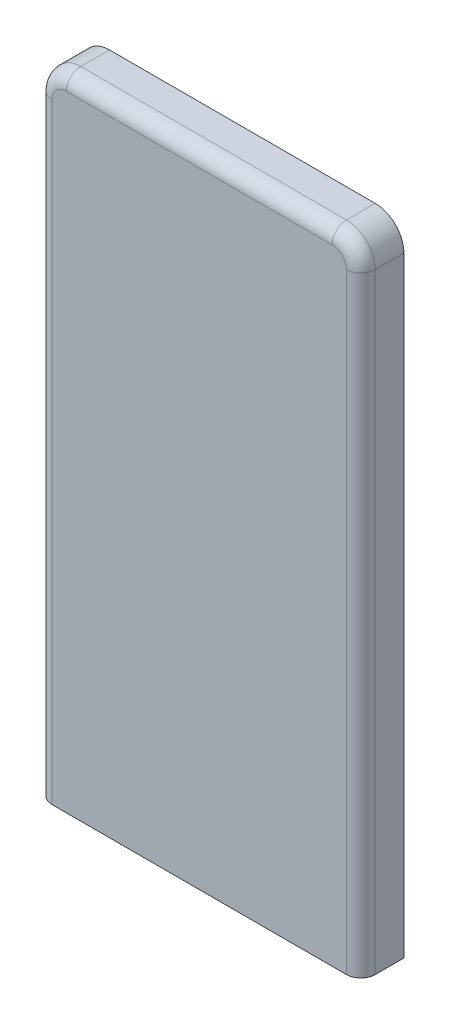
ISO-10303-21;
HEADER;
FILE_DESCRIPTION(('STEP AP214'),'2;1');
FILE_NAME('part.step','',(''),(''),'','','');
FILE_SCHEMA(('AUTOMOTIVE_DESIGN { 1 0 10303 214 1 1 1 1 }'));
ENDSEC;
DATA;
#1=APPLICATION_CONTEXT('core data for automotive mechanical design processes');
#2=APPLICATION_PROTOCOL_DEFINITION('international standard','automotive_design',2000,#1);
#3=PRODUCT_CONTEXT('',#1,'mechanical');
#4=PRODUCT('Part','Part','',(#3));
#5=PRODUCT_RELATED_PRODUCT_CATEGORY('part','',(#4));
#6=PRODUCT_DEFINITION_FORMATION('','',#4);
#7=PRODUCT_DEFINITION_CONTEXT('part definition',#1,'design');
#8=PRODUCT_DEFINITION('design','',#6,#7);
#9=PRODUCT_DEFINITION_SHAPE('','',#8);
#10=(LENGTH_UNIT() NAMED_UNIT(*) SI_UNIT(.MILLI.,.METRE.));
#11=(NAMED_UNIT(*) PLANE_ANGLE_UNIT() SI_UNIT($,.RADIAN.));
#12=(NAMED_UNIT(*) SI_UNIT($,.STERADIAN.) SOLID_ANGLE_UNIT());
#13=UNCERTAINTY_MEASURE_WITH_UNIT(LENGTH_MEASURE(1.E-05),#10,'distance_accuracy_value','');
#14=(GEOMETRIC_REPRESENTATION_CONTEXT(3) GLOBAL_UNCERTAINTY_ASSIGNED_CONTEXT((#13)) GLOBAL_UNIT_ASSIGNED_CONTEXT((#10,
#11,#12)) REPRESENTATION_CONTEXT('',''));
#15=CARTESIAN_POINT('',(0.,0.,0.));
#16=DIRECTION('',(0.,0.,1.));
#17=DIRECTION('',(1.,0.,0.));
#18=AXIS2_PLACEMENT_3D('',#15,#16,#17);
#19=CARTESIAN_POINT('',(-112.5,143.5,-30.));
#20=DIRECTION('',(-1.,0.,0.));
#21=DIRECTION('',(0.,-1.,0.));
#22=AXIS2_PLACEMENT_3D('',#19,#20,#21);
#23=PLANE('',#22);
#24=DIRECTION('',(0.,0.,1.));
#25=VECTOR('',#24,1.);
#26=CARTESIAN_POINT('',(-112.5,-301.5,-30.));
#27=LINE('',#26,#25);
#28=CARTESIAN_POINT('',(-112.5,-301.5,-30.));
#29=VERTEX_POINT('',#28);
#30=CARTESIAN_POINT('',(-112.5,-301.5,-10.));
#31=VERTEX_POINT('',#30);
#32=EDGE_CURVE('E260',#29,#31,#27,.T.);
#33=ORIENTED_EDGE('',*,*,#32,.T.);
#34=DIRECTION('',(0.,-1.,0.));
#35=VECTOR('',#34,1.);
#36=CARTESIAN_POINT('',(-112.5,143.5,-10.));
#37=LINE('',#36,#35);
#38=CARTESIAN_POINT('',(-112.5,123.5,-10.));
#39=VERTEX_POINT('',#38);
#40=EDGE_CURVE('E298',#31,#39,#37,.F.);
#41=ORIENTED_EDGE('',*,*,#40,.T.);
#42=DIRECTION('',(0.,0.,1.));
#43=VECTOR('',#42,1.);
#44=CARTESIAN_POINT('',(-112.5,123.5,-30.));
#45=LINE('',#44,#43);
#46=CARTESIAN_POINT('',(-112.5,123.5,-30.));
#47=VERTEX_POINT('',#46);
#48=EDGE_CURVE('E279',#39,#47,#45,.F.);
#49=ORIENTED_EDGE('',*,*,#48,.T.);
#50=DIRECTION('',(0.,-1.,0.));
#51=VECTOR('',#50,1.);
#52=CARTESIAN_POINT('',(-112.5,143.5,-30.));
#53=LINE('',#52,#51);
#54=EDGE_CURVE('E247',#47,#29,#53,.T.);
#55=ORIENTED_EDGE('',*,*,#54,.T.);
#56=EDGE_LOOP('',(#33,#41,#49,#55));
#57=FACE_BOUND('',#56,.T.);
#58=ADVANCED_FACE('F38',(#57),#23,.T.);
#59=CARTESIAN_POINT('',(-112.5,143.5,-30.));
#60=DIRECTION('',(0.,1.,0.));
#61=DIRECTION('',(-1.,0.,0.));
#62=AXIS2_PLACEMENT_3D('',#59,#60,#61);
#63=PLANE('',#62);
#64=DIRECTION('',(0.,0.,1.));
#65=VECTOR('',#64,1.);
#66=CARTESIAN_POINT('',(-92.5,143.5,-30.));
#67=LINE('',#66,#65);
#68=CARTESIAN_POINT('',(-92.5,143.5,-30.));
#69=VERTEX_POINT('',#68);
#70=CARTESIAN_POINT('',(-92.5,143.5,-10.));
#71=VERTEX_POINT('',#70);
#72=EDGE_CURVE('E271',#69,#71,#67,.T.);
#73=ORIENTED_EDGE('',*,*,#72,.T.);
#74=DIRECTION('',(-1.,0.,0.));
#75=VECTOR('',#74,1.);
#76=CARTESIAN_POINT('',(-112.5,143.5,-10.));
#77=LINE('',#76,#75);
#78=CARTESIAN_POINT('',(92.5,143.5,-10.));
#79=VERTEX_POINT('',#78);
#80=EDGE_CURVE('E11',#71,#79,#77,.F.);
#81=ORIENTED_EDGE('',*,*,#80,.T.);
#82=DIRECTION('',(0.,0.,1.));
#83=VECTOR('',#82,1.);
#84=CARTESIAN_POINT('',(92.5,143.5,-30.));
#85=LINE('',#84,#83);
#86=CARTESIAN_POINT('',(92.5,143.5,-30.));
#87=VERTEX_POINT('',#86);
#88=EDGE_CURVE('E273',#79,#87,#85,.F.);
#89=ORIENTED_EDGE('',*,*,#88,.T.);
#90=DIRECTION('',(-1.,0.,0.));
#91=VECTOR('',#90,1.);
#92=CARTESIAN_POINT('',(-112.5,143.5,-30.));
#93=LINE('',#92,#91);
#94=EDGE_CURVE('E257',#87,#69,#93,.T.);
#95=ORIENTED_EDGE('',*,*,#94,.T.);
#96=EDGE_LOOP('',(#73,#81,#89,#95));
#97=FACE_BOUND('',#96,.T.);
#98=ADVANCED_FACE('F356',(#97),#63,.T.);
#99=CARTESIAN_POINT('',(112.5,143.5,-30.));
#100=DIRECTION('',(1.,0.,0.));
#101=DIRECTION('',(0.,1.,0.));
#102=AXIS2_PLACEMENT_3D('',#99,#100,#101);
#103=PLANE('',#102);
#104=DIRECTION('',(0.,0.,1.));
#105=VECTOR('',#104,1.);
#106=CARTESIAN_POINT('',(112.5,123.5,-30.));
#107=LINE('',#106,#105);
#108=CARTESIAN_POINT('',(112.5,123.5,-30.));
#109=VERTEX_POINT('',#108);
#110=CARTESIAN_POINT('',(112.5,123.5,-10.));
#111=VERTEX_POINT('',#110);
#112=EDGE_CURVE('E266',#109,#111,#107,.T.);
#113=ORIENTED_EDGE('',*,*,#112,.T.);
#114=DIRECTION('',(0.,1.,0.));
#115=VECTOR('',#114,1.);
#116=CARTESIAN_POINT('',(112.5,143.5,-10.));
#117=LINE('',#116,#115);
#118=CARTESIAN_POINT('',(112.5,-301.5,-10.));
#119=VERTEX_POINT('',#118);
#120=EDGE_CURVE('E292',#111,#119,#117,.F.);
#121=ORIENTED_EDGE('',*,*,#120,.T.);
#122=DIRECTION('',(0.,0.,1.));
#123=VECTOR('',#122,1.);
#124=CARTESIAN_POINT('',(112.5,-301.5,-30.));
#125=LINE('',#124,#123);
#126=CARTESIAN_POINT('',(112.5,-301.5,-30.));
#127=VERTEX_POINT('',#126);
#128=EDGE_CURVE('E263',#127,#119,#125,.T.);
#129=ORIENTED_EDGE('',*,*,#128,.F.);
#130=DIRECTION('',(0.,1.,0.));
#131=VECTOR('',#130,1.);
#132=CARTESIAN_POINT('',(112.5,143.5,-30.));
#133=LINE('',#132,#131);
#134=EDGE_CURVE('E254',#127,#109,#133,.T.);
#135=ORIENTED_EDGE('',*,*,#134,.T.);
#136=EDGE_LOOP('',(#113,#121,#129,#135));
#137=FACE_BOUND('',#136,.T.);
#138=ADVANCED_FACE('F347',(#137),#103,.T.);
#139=CARTESIAN_POINT('',(-112.5,-301.5,-30.));
#140=DIRECTION('',(0.,-1.,0.));
#141=DIRECTION('',(0.,0.,-1.));
#142=AXIS2_PLACEMENT_3D('',#139,#140,#141);
#143=PLANE('',#142);
#144=DIRECTION('',(0.,0.,1.));
#145=VECTOR('',#144,1.);
#146=CARTESIAN_POINT('',(110.5,-301.5,-30.));
#147=LINE('',#146,#145);
#148=CARTESIAN_POINT('',(110.5,-301.5,-30.));
#149=VERTEX_POINT('',#148);
#150=CARTESIAN_POINT('',(110.5,-301.5,-10.));
#151=VERTEX_POINT('',#150);
#152=EDGE_CURVE('E212',#149,#151,#147,.T.);
#153=ORIENTED_EDGE('',*,*,#152,.F.);
#154=DIRECTION('',(1.,0.,0.));
#155=VECTOR('',#154,1.);
#156=CARTESIAN_POINT('',(-112.5,-301.5,-30.));
#157=LINE('',#156,#155);
#158=EDGE_CURVE('E249',#149,#127,#157,.T.);
#159=ORIENTED_EDGE('',*,*,#158,.T.);
#160=ORIENTED_EDGE('',*,*,#128,.T.);
#161=CARTESIAN_POINT('',(102.5,-301.5,-10.));
#162=DIRECTION('',(0.,-1.,0.));
#163=DIRECTION('',(0.,0.,-1.));
#164=AXIS2_PLACEMENT_3D('',#161,#162,#163);
#165=CIRCLE('',#164,10.);
#166=CARTESIAN_POINT('',(102.5,-301.5,0.));
#167=VERTEX_POINT('',#166);
#168=EDGE_CURVE('E296',#119,#167,#165,.T.);
#169=ORIENTED_EDGE('',*,*,#168,.T.);
#170=DIRECTION('',(1.,0.,0.));
#171=VECTOR('',#170,1.);
#172=CARTESIAN_POINT('',(-112.5,-301.5,0.));
#173=LINE('',#172,#171);
#174=CARTESIAN_POINT('',(-102.5,-301.5,0.));
#175=VERTEX_POINT('',#174);
#176=EDGE_CURVE('E250',#175,#167,#173,.T.);
#177=ORIENTED_EDGE('',*,*,#176,.F.);
#178=CARTESIAN_POINT('',(-102.5,-301.5,-10.));
#179=DIRECTION('',(0.,-1.,0.));
#180=DIRECTION('',(0.,0.,-1.));
#181=AXIS2_PLACEMENT_3D('',#178,#179,#180);
#182=CIRCLE('',#181,10.);
#183=EDGE_CURVE('E294',#175,#31,#182,.T.);
#184=ORIENTED_EDGE('',*,*,#183,.T.);
#185=ORIENTED_EDGE('',*,*,#32,.F.);
#186=CARTESIAN_POINT('',(-110.5,-301.5,-30.));
#187=VERTEX_POINT('',#186);
#188=EDGE_CURVE('E251',#29,#187,#157,.T.);
#189=ORIENTED_EDGE('',*,*,#188,.T.);
#190=DIRECTION('',(0.,0.,1.));
#191=VECTOR('',#190,1.);
#192=CARTESIAN_POINT('',(-110.5,-301.5,-30.));
#193=LINE('',#192,#191);
#194=CARTESIAN_POINT('',(-110.5,-301.5,-10.));
#195=VERTEX_POINT('',#194);
#196=EDGE_CURVE('E230',#187,#195,#193,.T.);
#197=ORIENTED_EDGE('',*,*,#196,.T.);
#198=CARTESIAN_POINT('',(-102.5,-301.5,-10.));
#199=DIRECTION('',(0.,-1.,0.));
#200=DIRECTION('',(0.,0.,-1.));
#201=AXIS2_PLACEMENT_3D('',#198,#199,#200);
#202=CIRCLE('',#201,8.);
#203=CARTESIAN_POINT('',(-102.5,-301.5,-2.));
#204=VERTEX_POINT('',#203);
#205=EDGE_CURVE('E171',#204,#195,#202,.T.);
#206=ORIENTED_EDGE('',*,*,#205,.F.);
#207=DIRECTION('',(1.,0.,0.));
#208=VECTOR('',#207,1.);
#209=CARTESIAN_POINT('',(-112.5,-301.5,-2.));
#210=LINE('',#209,#208);
#211=CARTESIAN_POINT('',(102.5,-301.5,-2.));
#212=VERTEX_POINT('',#211);
#213=EDGE_CURVE('E192',#204,#212,#210,.T.);
#214=ORIENTED_EDGE('',*,*,#213,.T.);
#215=CARTESIAN_POINT('',(102.5,-301.5,-10.));
#216=DIRECTION('',(0.,-1.,0.));
#217=DIRECTION('',(0.,0.,-1.));
#218=AXIS2_PLACEMENT_3D('',#215,#216,#217);
#219=CIRCLE('',#218,8.);
#220=EDGE_CURVE('E174',#151,#212,#219,.T.);
#221=ORIENTED_EDGE('',*,*,#220,.F.);
#222=EDGE_LOOP('',(#153,#159,#160,#169,#177,#184,#185,#189,#197,#206,#214,#221));
#223=FACE_BOUND('',#222,.T.);
#224=ADVANCED_FACE('F327',(#223),#143,.T.);
#225=CARTESIAN_POINT('',(-112.5,143.5,-30.));
#226=DIRECTION('',(0.,0.,1.));
#227=DIRECTION('',(1.,0.,0.));
#228=AXIS2_PLACEMENT_3D('',#225,#226,#227);
#229=PLANE('',#228);
#230=ORIENTED_EDGE('',*,*,#158,.F.);
#231=DIRECTION('',(0.,1.,0.));
#232=VECTOR('',#231,1.);
#233=CARTESIAN_POINT('',(110.5,143.5,-30.));
#234=LINE('',#233,#232);
#235=CARTESIAN_POINT('',(110.5,123.5,-30.));
#236=VERTEX_POINT('',#235);
#237=EDGE_CURVE('E234',#149,#236,#234,.T.);
#238=ORIENTED_EDGE('',*,*,#237,.T.);
#239=CARTESIAN_POINT('',(92.5,123.5,-30.));
#240=DIRECTION('',(0.,0.,1.));
#241=DIRECTION('',(1.,0.,0.));
#242=AXIS2_PLACEMENT_3D('',#239,#240,#241);
#243=CIRCLE('',#242,18.);
#244=CARTESIAN_POINT('',(92.5,141.5,-30.));
#245=VERTEX_POINT('',#244);
#246=EDGE_CURVE('E182',#245,#236,#243,.F.);
#247=ORIENTED_EDGE('',*,*,#246,.F.);
#248=DIRECTION('',(-1.,0.,0.));
#249=VECTOR('',#248,1.);
#250=CARTESIAN_POINT('',(-112.5,141.5,-30.));
#251=LINE('',#250,#249);
#252=CARTESIAN_POINT('',(-92.5,141.5,-30.));
#253=VERTEX_POINT('',#252);
#254=EDGE_CURVE('E232',#245,#253,#251,.T.);
#255=ORIENTED_EDGE('',*,*,#254,.T.);
#256=CARTESIAN_POINT('',(-92.5,123.5,-30.));
#257=DIRECTION('',(0.,0.,1.));
#258=DIRECTION('',(1.,0.,0.));
#259=AXIS2_PLACEMENT_3D('',#256,#257,#258);
#260=CIRCLE('',#259,18.);
#261=CARTESIAN_POINT('',(-110.5,123.5,-30.));
#262=VERTEX_POINT('',#261);
#263=EDGE_CURVE('E208',#262,#253,#260,.F.);
#264=ORIENTED_EDGE('',*,*,#263,.F.);
#265=DIRECTION('',(0.,-1.,0.));
#266=VECTOR('',#265,1.);
#267=CARTESIAN_POINT('',(-110.5,143.5,-30.));
#268=LINE('',#267,#266);
#269=EDGE_CURVE('E55',#262,#187,#268,.T.);
#270=ORIENTED_EDGE('',*,*,#269,.T.);
#271=ORIENTED_EDGE('',*,*,#188,.F.);
#272=ORIENTED_EDGE('',*,*,#54,.F.);
#273=CARTESIAN_POINT('',(-92.5,123.5,-30.));
#274=DIRECTION('',(0.,0.,1.));
#275=DIRECTION('',(1.,0.,0.));
#276=AXIS2_PLACEMENT_3D('',#273,#274,#275);
#277=CIRCLE('',#276,20.);
#278=EDGE_CURVE('E275',#47,#69,#277,.F.);
#279=ORIENTED_EDGE('',*,*,#278,.T.);
#280=ORIENTED_EDGE('',*,*,#94,.F.);
#281=CARTESIAN_POINT('',(92.5,123.5,-30.));
#282=DIRECTION('',(0.,0.,1.));
#283=DIRECTION('',(1.,0.,0.));
#284=AXIS2_PLACEMENT_3D('',#281,#282,#283);
#285=CIRCLE('',#284,20.);
#286=EDGE_CURVE('E277',#87,#109,#285,.F.);
#287=ORIENTED_EDGE('',*,*,#286,.T.);
#288=ORIENTED_EDGE('',*,*,#134,.F.);
#289=EDGE_LOOP('',(#230,#238,#247,#255,#264,#270,#271,#272,#279,#280,#287,#288));
#290=FACE_BOUND('',#289,.T.);
#291=ADVANCED_FACE('F351',(#290),#229,.F.);
#292=CARTESIAN_POINT('',(-112.5,143.5,0.));
#293=DIRECTION('',(0.,0.,1.));
#294=DIRECTION('',(1.,0.,0.));
#295=AXIS2_PLACEMENT_3D('',#292,#293,#294);
#296=PLANE('',#295);
#297=ORIENTED_EDGE('',*,*,#176,.T.);
#298=DIRECTION('',(0.,1.,0.));
#299=VECTOR('',#298,1.);
#300=CARTESIAN_POINT('',(102.5,143.5,0.));
#301=LINE('',#300,#299);
#302=CARTESIAN_POINT('',(102.5,123.5,0.));
#303=VERTEX_POINT('',#302);
#304=EDGE_CURVE('E289',#167,#303,#301,.T.);
#305=ORIENTED_EDGE('',*,*,#304,.T.);
#306=CARTESIAN_POINT('',(92.5,123.5,0.));
#307=DIRECTION('',(0.,0.,1.));
#308=DIRECTION('',(1.,0.,0.));
#309=AXIS2_PLACEMENT_3D('',#306,#307,#308);
#310=CIRCLE('',#309,10.);
#311=CARTESIAN_POINT('',(92.5,133.5,0.));
#312=VERTEX_POINT('',#311);
#313=EDGE_CURVE('E285',#303,#312,#310,.T.);
#314=ORIENTED_EDGE('',*,*,#313,.T.);
#315=DIRECTION('',(-1.,0.,0.));
#316=VECTOR('',#315,1.);
#317=CARTESIAN_POINT('',(-112.5,133.5,0.));
#318=LINE('',#317,#316);
#319=CARTESIAN_POINT('',(-92.5,133.5,0.));
#320=VERTEX_POINT('',#319);
#321=EDGE_CURVE('E281',#312,#320,#318,.T.);
#322=ORIENTED_EDGE('',*,*,#321,.T.);
#323=CARTESIAN_POINT('',(-92.5,123.5,0.));
#324=DIRECTION('',(0.,0.,1.));
#325=DIRECTION('',(1.,0.,0.));
#326=AXIS2_PLACEMENT_3D('',#323,#324,#325);
#327=CIRCLE('',#326,10.);
#328=CARTESIAN_POINT('',(-102.5,123.5,0.));
#329=VERTEX_POINT('',#328);
#330=EDGE_CURVE('E283',#320,#329,#327,.T.);
#331=ORIENTED_EDGE('',*,*,#330,.T.);
#332=DIRECTION('',(0.,-1.,0.));
#333=VECTOR('',#332,1.);
#334=CARTESIAN_POINT('',(-102.5,143.5,0.));
#335=LINE('',#334,#333);
#336=EDGE_CURVE('E287',#329,#175,#335,.T.);
#337=ORIENTED_EDGE('',*,*,#336,.T.);
#338=EDGE_LOOP('',(#297,#305,#314,#322,#331,#337));
#339=FACE_BOUND('',#338,.T.);
#340=ADVANCED_FACE('F323',(#339),#296,.T.);
#341=CARTESIAN_POINT('',(92.5,123.5,-30.));
#342=DIRECTION('',(0.,0.,1.));
#343=DIRECTION('',(1.,0.,0.));
#344=AXIS2_PLACEMENT_3D('',#341,#342,#343);
#345=CYLINDRICAL_SURFACE('',#344,20.);
#346=ORIENTED_EDGE('',*,*,#88,.F.);
#347=CARTESIAN_POINT('',(92.5,123.5,-10.));
#348=DIRECTION('',(0.,0.,1.));
#349=DIRECTION('',(1.,0.,0.));
#350=AXIS2_PLACEMENT_3D('',#347,#348,#349);
#351=CIRCLE('',#350,20.);
#352=EDGE_CURVE('E300',#79,#111,#351,.F.);
#353=ORIENTED_EDGE('',*,*,#352,.T.);
#354=ORIENTED_EDGE('',*,*,#112,.F.);
#355=ORIENTED_EDGE('',*,*,#286,.F.);
#356=EDGE_LOOP('',(#346,#353,#354,#355));
#357=FACE_BOUND('',#356,.T.);
#358=ADVANCED_FACE('F344',(#357),#345,.T.);
#359=CARTESIAN_POINT('',(-92.5,123.5,-30.));
#360=DIRECTION('',(0.,0.,1.));
#361=DIRECTION('',(1.,0.,0.));
#362=AXIS2_PLACEMENT_3D('',#359,#360,#361);
#363=CYLINDRICAL_SURFACE('',#362,20.);
#364=ORIENTED_EDGE('',*,*,#48,.F.);
#365=CARTESIAN_POINT('',(-92.5,123.5,-10.));
#366=DIRECTION('',(0.,0.,1.));
#367=DIRECTION('',(1.,0.,0.));
#368=AXIS2_PLACEMENT_3D('',#365,#366,#367);
#369=CIRCLE('',#368,20.);
#370=EDGE_CURVE('E47',#39,#71,#369,.F.);
#371=ORIENTED_EDGE('',*,*,#370,.T.);
#372=ORIENTED_EDGE('',*,*,#72,.F.);
#373=ORIENTED_EDGE('',*,*,#278,.F.);
#374=EDGE_LOOP('',(#364,#371,#372,#373));
#375=FACE_BOUND('',#374,.T.);
#376=ADVANCED_FACE('F357',(#375),#363,.T.);
#377=CARTESIAN_POINT('',(-102.5,143.5,-10.));
#378=DIRECTION('',(0.,-1.,0.));
#379=DIRECTION('',(1.,0.,0.));
#380=AXIS2_PLACEMENT_3D('',#377,#378,#379);
#381=CYLINDRICAL_SURFACE('',#380,10.);
#382=ORIENTED_EDGE('',*,*,#183,.F.);
#383=ORIENTED_EDGE('',*,*,#336,.F.);
#384=CARTESIAN_POINT('',(-102.5,123.5,-10.));
#385=DIRECTION('',(0.,1.,0.));
#386=DIRECTION('',(0.,0.,1.));
#387=AXIS2_PLACEMENT_3D('',#384,#385,#386);
#388=CIRCLE('',#387,10.);
#389=EDGE_CURVE('E42',#39,#329,#388,.T.);
#390=ORIENTED_EDGE('',*,*,#389,.F.);
#391=ORIENTED_EDGE('',*,*,#40,.F.);
#392=EDGE_LOOP('',(#382,#383,#390,#391));
#393=FACE_BOUND('',#392,.T.);
#394=ADVANCED_FACE('F40',(#393),#381,.T.);
#395=CARTESIAN_POINT('',(-92.5,123.5,-10.));
#396=DIRECTION('',(0.,0.,1.));
#397=DIRECTION('',(1.,0.,0.));
#398=AXIS2_PLACEMENT_3D('',#395,#396,#397);
#399=DEGENERATE_TOROIDAL_SURFACE('',#398,10.,10.,.T.);
#400=ORIENTED_EDGE('',*,*,#389,.T.);
#401=ORIENTED_EDGE('',*,*,#330,.F.);
#402=CARTESIAN_POINT('',(-92.5,133.5,-10.));
#403=DIRECTION('',(1.,0.,0.));
#404=DIRECTION('',(0.,0.,-1.));
#405=AXIS2_PLACEMENT_3D('',#402,#403,#404);
#406=CIRCLE('',#405,10.);
#407=EDGE_CURVE('E306',#71,#320,#406,.T.);
#408=ORIENTED_EDGE('',*,*,#407,.F.);
#409=ORIENTED_EDGE('',*,*,#370,.F.);
#410=EDGE_LOOP('',(#400,#401,#408,#409));
#411=FACE_BOUND('',#410,.T.);
#412=ADVANCED_FACE('F316',(#411),#399,.T.);
#413=CARTESIAN_POINT('',(-112.5,133.5,-10.));
#414=DIRECTION('',(-1.,0.,0.));
#415=DIRECTION('',(0.,-1.,0.));
#416=AXIS2_PLACEMENT_3D('',#413,#414,#415);
#417=CYLINDRICAL_SURFACE('',#416,10.);
#418=ORIENTED_EDGE('',*,*,#407,.T.);
#419=ORIENTED_EDGE('',*,*,#321,.F.);
#420=CARTESIAN_POINT('',(92.5,133.5,-10.));
#421=DIRECTION('',(1.,0.,0.));
#422=DIRECTION('',(0.,0.,-1.));
#423=AXIS2_PLACEMENT_3D('',#420,#421,#422);
#424=CIRCLE('',#423,10.);
#425=EDGE_CURVE('E304',#79,#312,#424,.T.);
#426=ORIENTED_EDGE('',*,*,#425,.F.);
#427=ORIENTED_EDGE('',*,*,#80,.F.);
#428=EDGE_LOOP('',(#418,#419,#426,#427));
#429=FACE_BOUND('',#428,.T.);
#430=ADVANCED_FACE('F338',(#429),#417,.T.);
#431=CARTESIAN_POINT('',(92.5,123.5,-10.));
#432=DIRECTION('',(0.,0.,1.));
#433=DIRECTION('',(1.,0.,0.));
#434=AXIS2_PLACEMENT_3D('',#431,#432,#433);
#435=DEGENERATE_TOROIDAL_SURFACE('',#434,10.,10.,.T.);
#436=ORIENTED_EDGE('',*,*,#425,.T.);
#437=ORIENTED_EDGE('',*,*,#313,.F.);
#438=CARTESIAN_POINT('',(102.5,123.5,-10.));
#439=DIRECTION('',(0.,-1.,0.));
#440=DIRECTION('',(0.,0.,-1.));
#441=AXIS2_PLACEMENT_3D('',#438,#439,#440);
#442=CIRCLE('',#441,10.);
#443=EDGE_CURVE('E201',#111,#303,#442,.T.);
#444=ORIENTED_EDGE('',*,*,#443,.F.);
#445=ORIENTED_EDGE('',*,*,#352,.F.);
#446=EDGE_LOOP('',(#436,#437,#444,#445));
#447=FACE_BOUND('',#446,.T.);
#448=ADVANCED_FACE('F340',(#447),#435,.T.);
#449=CARTESIAN_POINT('',(102.5,143.5,-10.));
#450=DIRECTION('',(0.,1.,0.));
#451=DIRECTION('',(-1.,0.,0.));
#452=AXIS2_PLACEMENT_3D('',#449,#450,#451);
#453=CYLINDRICAL_SURFACE('',#452,10.);
#454=ORIENTED_EDGE('',*,*,#168,.F.);
#455=ORIENTED_EDGE('',*,*,#120,.F.);
#456=ORIENTED_EDGE('',*,*,#443,.T.);
#457=ORIENTED_EDGE('',*,*,#304,.F.);
#458=EDGE_LOOP('',(#454,#455,#456,#457));
#459=FACE_BOUND('',#458,.T.);
#460=ADVANCED_FACE('F333',(#459),#453,.T.);
#461=CARTESIAN_POINT('',(-110.5,143.5,-30.));
#462=DIRECTION('',(-1.,0.,0.));
#463=DIRECTION('',(0.,-1.,0.));
#464=AXIS2_PLACEMENT_3D('',#461,#462,#463);
#465=PLANE('',#464);
#466=ORIENTED_EDGE('',*,*,#196,.F.);
#467=ORIENTED_EDGE('',*,*,#269,.F.);
#468=DIRECTION('',(0.,0.,1.));
#469=VECTOR('',#468,1.);
#470=CARTESIAN_POINT('',(-110.5,123.5,-30.));
#471=LINE('',#470,#469);
#472=CARTESIAN_POINT('',(-110.5,123.5,-10.));
#473=VERTEX_POINT('',#472);
#474=EDGE_CURVE('E176',#473,#262,#471,.F.);
#475=ORIENTED_EDGE('',*,*,#474,.F.);
#476=DIRECTION('',(0.,-1.,0.));
#477=VECTOR('',#476,1.);
#478=CARTESIAN_POINT('',(-110.5,143.5,-10.));
#479=LINE('',#478,#477);
#480=EDGE_CURVE('E166',#195,#473,#479,.F.);
#481=ORIENTED_EDGE('',*,*,#480,.F.);
#482=EDGE_LOOP('',(#466,#467,#475,#481));
#483=FACE_BOUND('',#482,.T.);
#484=ADVANCED_FACE('F177',(#483),#465,.F.);
#485=CARTESIAN_POINT('',(-112.5,141.5,-30.));
#486=DIRECTION('',(0.,1.,0.));
#487=DIRECTION('',(-1.,0.,0.));
#488=AXIS2_PLACEMENT_3D('',#485,#486,#487);
#489=PLANE('',#488);
#490=DIRECTION('',(0.,0.,1.));
#491=VECTOR('',#490,1.);
#492=CARTESIAN_POINT('',(-92.5,141.5,-30.));
#493=LINE('',#492,#491);
#494=CARTESIAN_POINT('',(-92.5,141.5,-10.));
#495=VERTEX_POINT('',#494);
#496=EDGE_CURVE('E197',#253,#495,#493,.T.);
#497=ORIENTED_EDGE('',*,*,#496,.F.);
#498=ORIENTED_EDGE('',*,*,#254,.F.);
#499=DIRECTION('',(0.,0.,1.));
#500=VECTOR('',#499,1.);
#501=CARTESIAN_POINT('',(92.5,141.5,-30.));
#502=LINE('',#501,#500);
#503=CARTESIAN_POINT('',(92.5,141.5,-10.));
#504=VERTEX_POINT('',#503);
#505=EDGE_CURVE('E205',#504,#245,#502,.F.);
#506=ORIENTED_EDGE('',*,*,#505,.F.);
#507=DIRECTION('',(-1.,0.,0.));
#508=VECTOR('',#507,1.);
#509=CARTESIAN_POINT('',(-112.5,141.5,-10.));
#510=LINE('',#509,#508);
#511=EDGE_CURVE('E199',#495,#504,#510,.F.);
#512=ORIENTED_EDGE('',*,*,#511,.F.);
#513=EDGE_LOOP('',(#497,#498,#506,#512));
#514=FACE_BOUND('',#513,.T.);
#515=ADVANCED_FACE('F383',(#514),#489,.F.);
#516=CARTESIAN_POINT('',(110.5,143.5,-30.));
#517=DIRECTION('',(1.,0.,0.));
#518=DIRECTION('',(0.,1.,0.));
#519=AXIS2_PLACEMENT_3D('',#516,#517,#518);
#520=PLANE('',#519);
#521=DIRECTION('',(0.,0.,1.));
#522=VECTOR('',#521,1.);
#523=CARTESIAN_POINT('',(110.5,123.5,-30.));
#524=LINE('',#523,#522);
#525=CARTESIAN_POINT('',(110.5,123.5,-10.));
#526=VERTEX_POINT('',#525);
#527=EDGE_CURVE('E206',#236,#526,#524,.T.);
#528=ORIENTED_EDGE('',*,*,#527,.F.);
#529=ORIENTED_EDGE('',*,*,#237,.F.);
#530=ORIENTED_EDGE('',*,*,#152,.T.);
#531=DIRECTION('',(0.,1.,0.));
#532=VECTOR('',#531,1.);
#533=CARTESIAN_POINT('',(110.5,143.5,-10.));
#534=LINE('',#533,#532);
#535=EDGE_CURVE('E213',#526,#151,#534,.F.);
#536=ORIENTED_EDGE('',*,*,#535,.F.);
#537=EDGE_LOOP('',(#528,#529,#530,#536));
#538=FACE_BOUND('',#537,.T.);
#539=ADVANCED_FACE('F373',(#538),#520,.F.);
#540=CARTESIAN_POINT('',(-112.5,143.5,-2.));
#541=DIRECTION('',(0.,0.,1.));
#542=DIRECTION('',(1.,0.,0.));
#543=AXIS2_PLACEMENT_3D('',#540,#541,#542);
#544=PLANE('',#543);
#545=ORIENTED_EDGE('',*,*,#213,.F.);
#546=DIRECTION('',(0.,1.,0.));
#547=VECTOR('',#546,1.);
#548=CARTESIAN_POINT('',(-102.5,143.5,-2.));
#549=LINE('',#548,#547);
#550=CARTESIAN_POINT('',(-102.5,123.5,-2.));
#551=VERTEX_POINT('',#550);
#552=EDGE_CURVE('E222',#551,#204,#549,.F.);
#553=ORIENTED_EDGE('',*,*,#552,.F.);
#554=CARTESIAN_POINT('',(-92.5,123.5,-2.));
#555=DIRECTION('',(0.,0.,1.));
#556=DIRECTION('',(1.,0.,0.));
#557=AXIS2_PLACEMENT_3D('',#554,#555,#556);
#558=CIRCLE('',#557,9.99999999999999);
#559=CARTESIAN_POINT('',(-92.5,133.5,-2.));
#560=VERTEX_POINT('',#559);
#561=EDGE_CURVE('E190',#560,#551,#558,.T.);
#562=ORIENTED_EDGE('',*,*,#561,.F.);
#563=DIRECTION('',(1.,0.,0.));
#564=VECTOR('',#563,1.);
#565=CARTESIAN_POINT('',(-112.5,133.5,-2.));
#566=LINE('',#565,#564);
#567=CARTESIAN_POINT('',(92.5,133.5,-2.));
#568=VERTEX_POINT('',#567);
#569=EDGE_CURVE('E181',#568,#560,#566,.F.);
#570=ORIENTED_EDGE('',*,*,#569,.F.);
#571=CARTESIAN_POINT('',(92.5,123.5,-2.));
#572=DIRECTION('',(0.,0.,1.));
#573=DIRECTION('',(1.,0.,0.));
#574=AXIS2_PLACEMENT_3D('',#571,#572,#573);
#575=CIRCLE('',#574,9.99999999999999);
#576=CARTESIAN_POINT('',(102.5,123.5,-2.));
#577=VERTEX_POINT('',#576);
#578=EDGE_CURVE('E220',#577,#568,#575,.T.);
#579=ORIENTED_EDGE('',*,*,#578,.F.);
#580=DIRECTION('',(0.,1.,0.));
#581=VECTOR('',#580,1.);
#582=CARTESIAN_POINT('',(102.5,143.5,-2.));
#583=LINE('',#582,#581);
#584=EDGE_CURVE('E215',#212,#577,#583,.T.);
#585=ORIENTED_EDGE('',*,*,#584,.F.);
#586=EDGE_LOOP('',(#545,#553,#562,#570,#579,#585));
#587=FACE_BOUND('',#586,.T.);
#588=ADVANCED_FACE('F364',(#587),#544,.F.);
#589=CARTESIAN_POINT('',(92.5,123.5,-30.));
#590=DIRECTION('',(0.,0.,1.));
#591=DIRECTION('',(1.,0.,0.));
#592=AXIS2_PLACEMENT_3D('',#589,#590,#591);
#593=CYLINDRICAL_SURFACE('',#592,18.);
#594=ORIENTED_EDGE('',*,*,#505,.T.);
#595=ORIENTED_EDGE('',*,*,#246,.T.);
#596=ORIENTED_EDGE('',*,*,#527,.T.);
#597=CARTESIAN_POINT('',(92.5,123.5,-10.));
#598=DIRECTION('',(0.,0.,1.));
#599=DIRECTION('',(1.,0.,0.));
#600=AXIS2_PLACEMENT_3D('',#597,#598,#599);
#601=CIRCLE('',#600,18.);
#602=EDGE_CURVE('E173',#504,#526,#601,.F.);
#603=ORIENTED_EDGE('',*,*,#602,.F.);
#604=EDGE_LOOP('',(#594,#595,#596,#603));
#605=FACE_BOUND('',#604,.T.);
#606=ADVANCED_FACE('F377',(#605),#593,.F.);
#607=CARTESIAN_POINT('',(-92.5,123.5,-30.));
#608=DIRECTION('',(0.,0.,1.));
#609=DIRECTION('',(1.,0.,0.));
#610=AXIS2_PLACEMENT_3D('',#607,#608,#609);
#611=CYLINDRICAL_SURFACE('',#610,18.);
#612=ORIENTED_EDGE('',*,*,#474,.T.);
#613=ORIENTED_EDGE('',*,*,#263,.T.);
#614=ORIENTED_EDGE('',*,*,#496,.T.);
#615=CARTESIAN_POINT('',(-92.5,123.5,-10.));
#616=DIRECTION('',(0.,0.,1.));
#617=DIRECTION('',(1.,0.,0.));
#618=AXIS2_PLACEMENT_3D('',#615,#616,#617);
#619=CIRCLE('',#618,18.);
#620=EDGE_CURVE('E187',#473,#495,#619,.F.);
#621=ORIENTED_EDGE('',*,*,#620,.F.);
#622=EDGE_LOOP('',(#612,#613,#614,#621));
#623=FACE_BOUND('',#622,.T.);
#624=ADVANCED_FACE('F195',(#623),#611,.F.);
#625=CARTESIAN_POINT('',(-102.5,143.5,-10.));
#626=DIRECTION('',(0.,-1.,0.));
#627=DIRECTION('',(1.,0.,0.));
#628=AXIS2_PLACEMENT_3D('',#625,#626,#627);
#629=CYLINDRICAL_SURFACE('',#628,8.);
#630=ORIENTED_EDGE('',*,*,#205,.T.);
#631=ORIENTED_EDGE('',*,*,#480,.T.);
#632=CARTESIAN_POINT('',(-102.5,123.5,-10.));
#633=DIRECTION('',(0.,1.,0.));
#634=DIRECTION('',(-1.,0.,0.));
#635=AXIS2_PLACEMENT_3D('',#632,#633,#634);
#636=CIRCLE('',#635,8.);
#637=EDGE_CURVE('E169',#473,#551,#636,.T.);
#638=ORIENTED_EDGE('',*,*,#637,.T.);
#639=ORIENTED_EDGE('',*,*,#552,.T.);
#640=EDGE_LOOP('',(#630,#631,#638,#639));
#641=FACE_BOUND('',#640,.T.);
#642=ADVANCED_FACE('F167',(#641),#629,.F.);
#643=CARTESIAN_POINT('',(-92.5,123.5,-10.));
#644=DIRECTION('',(0.,0.,1.));
#645=DIRECTION('',(1.,0.,0.));
#646=AXIS2_PLACEMENT_3D('',#643,#644,#645);
#647=TOROIDAL_SURFACE('',#646,10.,8.);
#648=ORIENTED_EDGE('',*,*,#637,.F.);
#649=ORIENTED_EDGE('',*,*,#620,.T.);
#650=CARTESIAN_POINT('',(-92.5,133.5,-10.));
#651=DIRECTION('',(-1.,0.,0.));
#652=DIRECTION('',(0.,-1.,0.));
#653=AXIS2_PLACEMENT_3D('',#650,#651,#652);
#654=CIRCLE('',#653,8.);
#655=EDGE_CURVE('E193',#495,#560,#654,.F.);
#656=ORIENTED_EDGE('',*,*,#655,.T.);
#657=ORIENTED_EDGE('',*,*,#561,.T.);
#658=EDGE_LOOP('',(#648,#649,#656,#657));
#659=FACE_BOUND('',#658,.T.);
#660=ADVANCED_FACE('F185',(#659),#647,.F.);
#661=CARTESIAN_POINT('',(-112.5,133.5,-10.));
#662=DIRECTION('',(-1.,0.,0.));
#663=DIRECTION('',(0.,-1.,0.));
#664=AXIS2_PLACEMENT_3D('',#661,#662,#663);
#665=CYLINDRICAL_SURFACE('',#664,8.);
#666=ORIENTED_EDGE('',*,*,#655,.F.);
#667=ORIENTED_EDGE('',*,*,#511,.T.);
#668=CARTESIAN_POINT('',(92.5,133.5,-10.));
#669=DIRECTION('',(1.,0.,0.));
#670=DIRECTION('',(0.,1.,0.));
#671=AXIS2_PLACEMENT_3D('',#668,#669,#670);
#672=CIRCLE('',#671,8.);
#673=EDGE_CURVE('E216',#504,#568,#672,.T.);
#674=ORIENTED_EDGE('',*,*,#673,.T.);
#675=ORIENTED_EDGE('',*,*,#569,.T.);
#676=EDGE_LOOP('',(#666,#667,#674,#675));
#677=FACE_BOUND('',#676,.T.);
#678=ADVANCED_FACE('F385',(#677),#665,.F.);
#679=CARTESIAN_POINT('',(92.5,123.5,-10.));
#680=DIRECTION('',(0.,0.,1.));
#681=DIRECTION('',(1.,0.,0.));
#682=AXIS2_PLACEMENT_3D('',#679,#680,#681);
#683=TOROIDAL_SURFACE('',#682,10.,8.);
#684=ORIENTED_EDGE('',*,*,#673,.F.);
#685=ORIENTED_EDGE('',*,*,#602,.T.);
#686=CARTESIAN_POINT('',(102.5,123.5,-10.));
#687=DIRECTION('',(0.,1.,0.));
#688=DIRECTION('',(-1.,0.,0.));
#689=AXIS2_PLACEMENT_3D('',#686,#687,#688);
#690=CIRCLE('',#689,8.);
#691=EDGE_CURVE('E219',#526,#577,#690,.F.);
#692=ORIENTED_EDGE('',*,*,#691,.T.);
#693=ORIENTED_EDGE('',*,*,#578,.T.);
#694=EDGE_LOOP('',(#684,#685,#692,#693));
#695=FACE_BOUND('',#694,.T.);
#696=ADVANCED_FACE('F387',(#695),#683,.F.);
#697=CARTESIAN_POINT('',(102.5,143.5,-10.));
#698=DIRECTION('',(0.,1.,0.));
#699=DIRECTION('',(-1.,0.,0.));
#700=AXIS2_PLACEMENT_3D('',#697,#698,#699);
#701=CYLINDRICAL_SURFACE('',#700,8.);
#702=ORIENTED_EDGE('',*,*,#220,.T.);
#703=ORIENTED_EDGE('',*,*,#584,.T.);
#704=ORIENTED_EDGE('',*,*,#691,.F.);
#705=ORIENTED_EDGE('',*,*,#535,.T.);
#706=EDGE_LOOP('',(#702,#703,#704,#705));
#707=FACE_BOUND('',#706,.T.);
#708=ADVANCED_FACE('F369',(#707),#701,.F.);
#709=CLOSED_SHELL('',(#58,#98,#138,#224,#291,#340,#358,#376,#394,#412,#430,#448,#460,#484,#515,
#539,#588,#606,#624,#642,#660,#678,#696,#708));
#710=MANIFOLD_SOLID_BREP('B2',#709);
#711=ADVANCED_BREP_SHAPE_REPRESENTATION('',(#18,#710),#14);
#712=SHAPE_DEFINITION_REPRESENTATION(#9,#711);
ENDSEC;
END-ISO-10303-21;
